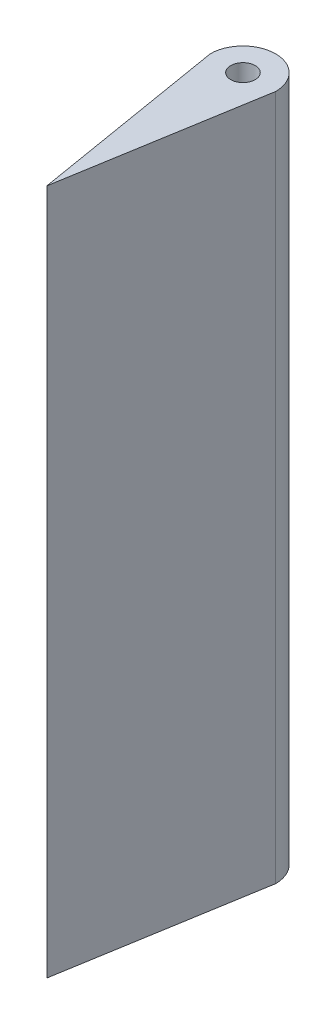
ISO-10303-21;
HEADER;
FILE_DESCRIPTION(('STEP AP214'),'2;1');
FILE_NAME('part.step','',(''),(''),'','','');
FILE_SCHEMA(('AUTOMOTIVE_DESIGN { 1 0 10303 214 1 1 1 1 }'));
ENDSEC;
DATA;
#1=APPLICATION_CONTEXT('core data for automotive mechanical design processes');
#2=APPLICATION_PROTOCOL_DEFINITION('international standard','automotive_design',2000,#1);
#3=PRODUCT_CONTEXT('',#1,'mechanical');
#4=PRODUCT('Part','Part','',(#3));
#5=PRODUCT_RELATED_PRODUCT_CATEGORY('part','',(#4));
#6=PRODUCT_DEFINITION_FORMATION('','',#4);
#7=PRODUCT_DEFINITION_CONTEXT('part definition',#1,'design');
#8=PRODUCT_DEFINITION('design','',#6,#7);
#9=PRODUCT_DEFINITION_SHAPE('','',#8);
#10=(LENGTH_UNIT() NAMED_UNIT(*) SI_UNIT(.MILLI.,.METRE.));
#11=(NAMED_UNIT(*) PLANE_ANGLE_UNIT() SI_UNIT($,.RADIAN.));
#12=(NAMED_UNIT(*) SI_UNIT($,.STERADIAN.) SOLID_ANGLE_UNIT());
#13=UNCERTAINTY_MEASURE_WITH_UNIT(LENGTH_MEASURE(1.E-05),#10,'distance_accuracy_value','');
#14=(GEOMETRIC_REPRESENTATION_CONTEXT(3) GLOBAL_UNCERTAINTY_ASSIGNED_CONTEXT((#13)) GLOBAL_UNIT_ASSIGNED_CONTEXT((#10,
#11,#12)) REPRESENTATION_CONTEXT('',''));
#15=CARTESIAN_POINT('',(0.,0.,0.));
#16=DIRECTION('',(0.,0.,1.));
#17=DIRECTION('',(1.,0.,0.));
#18=AXIS2_PLACEMENT_3D('',#15,#16,#17);
#19=CARTESIAN_POINT('',(0.,88.9,0.));
#20=DIRECTION('',(0.,-1.,0.));
#21=DIRECTION('',(0.,0.,-1.));
#22=AXIS2_PLACEMENT_3D('',#19,#20,#21);
#23=CYLINDRICAL_SURFACE('',#22,4.233333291);
#24=CARTESIAN_POINT('',(0.,0.,0.));
#25=DIRECTION('',(0.,1.,0.));
#26=DIRECTION('',(0.,0.,1.));
#27=AXIS2_PLACEMENT_3D('',#24,#25,#26);
#28=CIRCLE('',#27,4.233333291);
#29=CARTESIAN_POINT('',(4.233333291,0.,0.));
#30=VERTEX_POINT('',#29);
#31=CARTESIAN_POINT('',(-4.233333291,0.,0.));
#32=VERTEX_POINT('',#31);
#33=EDGE_CURVE('E80',#30,#32,#28,.T.);
#34=ORIENTED_EDGE('',*,*,#33,.T.);
#35=DIRECTION('',(0.,-1.,0.));
#36=VECTOR('',#35,1.);
#37=CARTESIAN_POINT('',(-4.233333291,88.9,0.));
#38=LINE('',#37,#36);
#39=CARTESIAN_POINT('',(-4.233333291,88.9,0.));
#40=VERTEX_POINT('',#39);
#41=EDGE_CURVE('E11',#40,#32,#38,.T.);
#42=ORIENTED_EDGE('',*,*,#41,.F.);
#43=CARTESIAN_POINT('',(0.,88.9,0.));
#44=DIRECTION('',(0.,1.,0.));
#45=DIRECTION('',(0.,0.,1.));
#46=AXIS2_PLACEMENT_3D('',#43,#44,#45);
#47=CIRCLE('',#46,4.233333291);
#48=CARTESIAN_POINT('',(4.233333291,88.9,0.));
#49=VERTEX_POINT('',#48);
#50=EDGE_CURVE('E73',#49,#40,#47,.T.);
#51=ORIENTED_EDGE('',*,*,#50,.F.);
#52=DIRECTION('',(0.,-1.,0.));
#53=VECTOR('',#52,1.);
#54=CARTESIAN_POINT('',(4.233333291,88.9,0.));
#55=LINE('',#54,#53);
#56=EDGE_CURVE('E81',#49,#30,#55,.T.);
#57=ORIENTED_EDGE('',*,*,#56,.T.);
#58=EDGE_LOOP('',(#34,#42,#51,#57));
#59=FACE_BOUND('',#58,.T.);
#60=ADVANCED_FACE('F33',(#59),#23,.T.);
#61=CARTESIAN_POINT('',(-4.233333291,88.9,0.));
#62=DIRECTION('',(0.986393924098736,0.,-0.1643989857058));
#63=DIRECTION('',(-0.1643989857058,0.,-0.986393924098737));
#64=AXIS2_PLACEMENT_3D('',#61,#62,#63);
#65=PLANE('',#64);
#66=DIRECTION('',(0.1643989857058,0.,0.986393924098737));
#67=VECTOR('',#66,1.);
#68=CARTESIAN_POINT('',(-4.233333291,0.,0.));
#69=LINE('',#68,#67);
#70=CARTESIAN_POINT('',(0.,0.,25.4));
#71=VERTEX_POINT('',#70);
#72=EDGE_CURVE('E61',#32,#71,#69,.T.);
#73=ORIENTED_EDGE('',*,*,#72,.T.);
#74=DIRECTION('',(0.,-1.,0.));
#75=VECTOR('',#74,1.);
#76=CARTESIAN_POINT('',(0.,88.9,25.4));
#77=LINE('',#76,#75);
#78=CARTESIAN_POINT('',(0.,88.9,25.4));
#79=VERTEX_POINT('',#78);
#80=EDGE_CURVE('E41',#79,#71,#77,.T.);
#81=ORIENTED_EDGE('',*,*,#80,.F.);
#82=DIRECTION('',(0.1643989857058,0.,0.986393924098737));
#83=VECTOR('',#82,1.);
#84=CARTESIAN_POINT('',(-4.233333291,88.9,0.));
#85=LINE('',#84,#83);
#86=EDGE_CURVE('E69',#40,#79,#85,.T.);
#87=ORIENTED_EDGE('',*,*,#86,.F.);
#88=ORIENTED_EDGE('',*,*,#41,.T.);
#89=EDGE_LOOP('',(#73,#81,#87,#88));
#90=FACE_BOUND('',#89,.T.);
#91=ADVANCED_FACE('F70',(#90),#65,.F.);
#92=CARTESIAN_POINT('',(0.,88.9,25.4));
#93=DIRECTION('',(-0.986393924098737,0.,-0.164398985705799));
#94=DIRECTION('',(-0.164398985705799,0.,0.986393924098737));
#95=AXIS2_PLACEMENT_3D('',#92,#93,#94);
#96=PLANE('',#95);
#97=DIRECTION('',(0.164398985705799,0.,-0.986393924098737));
#98=VECTOR('',#97,1.);
#99=CARTESIAN_POINT('',(0.,0.,25.4));
#100=LINE('',#99,#98);
#101=EDGE_CURVE('E66',#71,#30,#100,.T.);
#102=ORIENTED_EDGE('',*,*,#101,.T.);
#103=ORIENTED_EDGE('',*,*,#56,.F.);
#104=DIRECTION('',(0.164398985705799,0.,-0.986393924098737));
#105=VECTOR('',#104,1.);
#106=CARTESIAN_POINT('',(0.,88.9,25.4));
#107=LINE('',#106,#105);
#108=EDGE_CURVE('E49',#79,#49,#107,.T.);
#109=ORIENTED_EDGE('',*,*,#108,.F.);
#110=ORIENTED_EDGE('',*,*,#80,.T.);
#111=EDGE_LOOP('',(#102,#103,#109,#110));
#112=FACE_BOUND('',#111,.T.);
#113=ADVANCED_FACE('F92',(#112),#96,.F.);
#114=CARTESIAN_POINT('',(0.,88.9,0.));
#115=DIRECTION('',(0.,1.,0.));
#116=DIRECTION('',(0.,0.,1.));
#117=AXIS2_PLACEMENT_3D('',#114,#115,#116);
#118=PLANE('',#117);
#119=CARTESIAN_POINT('',(0.,88.9,0.));
#120=DIRECTION('',(0.,1.,0.));
#121=DIRECTION('',(0.,0.,1.));
#122=AXIS2_PLACEMENT_3D('',#119,#120,#121);
#123=CIRCLE('',#122,1.5875);
#124=CARTESIAN_POINT('',(0.,88.9,1.5875));
#125=VERTEX_POINT('',#124);
#126=EDGE_CURVE('E87',#125,#125,#123,.T.);
#127=ORIENTED_EDGE('',*,*,#126,.F.);
#128=EDGE_LOOP('',(#127));
#129=FACE_BOUND('',#128,.T.);
#130=ORIENTED_EDGE('',*,*,#50,.T.);
#131=ORIENTED_EDGE('',*,*,#86,.T.);
#132=ORIENTED_EDGE('',*,*,#108,.T.);
#133=EDGE_LOOP('',(#130,#131,#132));
#134=FACE_BOUND('',#133,.T.);
#135=ADVANCED_FACE('F76',(#129,#134),#118,.T.);
#136=CARTESIAN_POINT('',(0.,0.,0.));
#137=DIRECTION('',(0.,1.,0.));
#138=DIRECTION('',(0.,0.,1.));
#139=AXIS2_PLACEMENT_3D('',#136,#137,#138);
#140=PLANE('',#139);
#141=CARTESIAN_POINT('',(0.,0.,0.));
#142=DIRECTION('',(0.,1.,0.));
#143=DIRECTION('',(0.,0.,1.));
#144=AXIS2_PLACEMENT_3D('',#141,#142,#143);
#145=CIRCLE('',#144,1.5875);
#146=CARTESIAN_POINT('',(0.,0.,1.5875));
#147=VERTEX_POINT('',#146);
#148=EDGE_CURVE('E83',#147,#147,#145,.T.);
#149=ORIENTED_EDGE('',*,*,#148,.T.);
#150=EDGE_LOOP('',(#149));
#151=FACE_BOUND('',#150,.T.);
#152=ORIENTED_EDGE('',*,*,#33,.F.);
#153=ORIENTED_EDGE('',*,*,#101,.F.);
#154=ORIENTED_EDGE('',*,*,#72,.F.);
#155=EDGE_LOOP('',(#152,#153,#154));
#156=FACE_BOUND('',#155,.T.);
#157=ADVANCED_FACE('F93',(#151,#156),#140,.F.);
#158=CARTESIAN_POINT('',(0.,0.,0.));
#159=DIRECTION('',(0.,1.,0.));
#160=DIRECTION('',(0.,0.,1.));
#161=AXIS2_PLACEMENT_3D('',#158,#159,#160);
#162=CYLINDRICAL_SURFACE('',#161,1.5875);
#163=ORIENTED_EDGE('',*,*,#148,.F.);
#164=EDGE_LOOP('',(#163));
#165=FACE_BOUND('',#164,.T.);
#166=ORIENTED_EDGE('',*,*,#126,.T.);
#167=EDGE_LOOP('',(#166));
#168=FACE_BOUND('',#167,.T.);
#169=ADVANCED_FACE('F95',(#165,#168),#162,.F.);
#170=CLOSED_SHELL('',(#60,#91,#113,#135,#157,#169));
#171=MANIFOLD_SOLID_BREP('B2',#170);
#172=ADVANCED_BREP_SHAPE_REPRESENTATION('',(#18,#171),#14);
#173=SHAPE_DEFINITION_REPRESENTATION(#9,#172);
ENDSEC;
END-ISO-10303-21;
